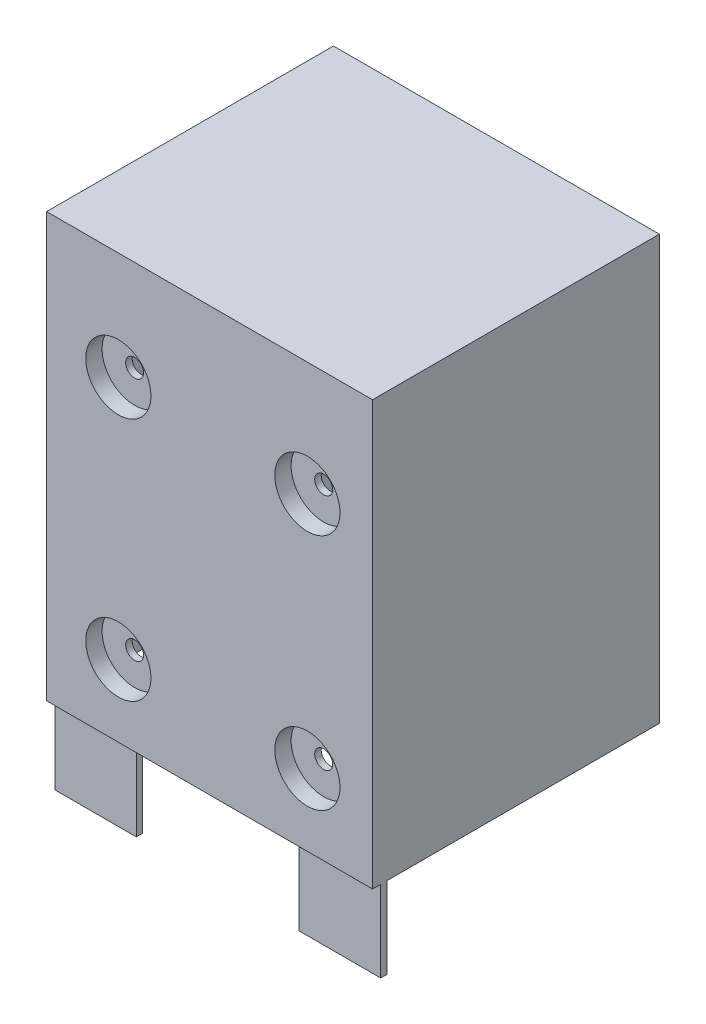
ISO-10303-21;
HEADER;
FILE_DESCRIPTION(('STEP AP214'),'2;1');
FILE_NAME('part.step','',(''),(''),'','','');
FILE_SCHEMA(('AUTOMOTIVE_DESIGN { 1 0 10303 214 1 1 1 1 }'));
ENDSEC;
DATA;
#1=APPLICATION_CONTEXT('core data for automotive mechanical design processes');
#2=APPLICATION_PROTOCOL_DEFINITION('international standard','automotive_design',2000,#1);
#3=PRODUCT_CONTEXT('',#1,'mechanical');
#4=PRODUCT('Part','Part','',(#3));
#5=PRODUCT_RELATED_PRODUCT_CATEGORY('part','',(#4));
#6=PRODUCT_DEFINITION_FORMATION('','',#4);
#7=PRODUCT_DEFINITION_CONTEXT('part definition',#1,'design');
#8=PRODUCT_DEFINITION('design','',#6,#7);
#9=PRODUCT_DEFINITION_SHAPE('','',#8);
#10=(LENGTH_UNIT() NAMED_UNIT(*) SI_UNIT(.MILLI.,.METRE.));
#11=(NAMED_UNIT(*) PLANE_ANGLE_UNIT() SI_UNIT($,.RADIAN.));
#12=(NAMED_UNIT(*) SI_UNIT($,.STERADIAN.) SOLID_ANGLE_UNIT());
#13=UNCERTAINTY_MEASURE_WITH_UNIT(LENGTH_MEASURE(1.E-05),#10,'distance_accuracy_value','');
#14=(GEOMETRIC_REPRESENTATION_CONTEXT(3) GLOBAL_UNCERTAINTY_ASSIGNED_CONTEXT((#13)) GLOBAL_UNIT_ASSIGNED_CONTEXT((#10,
#11,#12)) REPRESENTATION_CONTEXT('',''));
#15=CARTESIAN_POINT('',(0.,0.,0.));
#16=DIRECTION('',(0.,0.,1.));
#17=DIRECTION('',(1.,0.,0.));
#18=AXIS2_PLACEMENT_3D('',#15,#16,#17);
#19=CARTESIAN_POINT('',(0.,0.,0.));
#20=DIRECTION('',(0.,-1.,0.));
#21=DIRECTION('',(0.,0.,-1.));
#22=AXIS2_PLACEMENT_3D('',#19,#20,#21);
#23=PLANE('',#22);
#24=DIRECTION('',(0.,0.,-1.));
#25=VECTOR('',#24,1.);
#26=CARTESIAN_POINT('',(66.,0.,0.));
#27=LINE('',#26,#25);
#28=CARTESIAN_POINT('',(66.,0.,3.));
#29=VERTEX_POINT('',#28);
#30=CARTESIAN_POINT('',(66.,0.,0.0857864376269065));
#31=VERTEX_POINT('',#30);
#32=EDGE_CURVE('E435',#29,#31,#27,.T.);
#33=ORIENTED_EDGE('',*,*,#32,.T.);
#34=CARTESIAN_POINT('',(66.5,0.,1.5));
#35=DIRECTION('',(0.,-1.,0.));
#36=DIRECTION('',(0.,0.,-1.));
#37=AXIS2_PLACEMENT_3D('',#34,#35,#36);
#38=CIRCLE('',#37,1.5);
#39=CARTESIAN_POINT('',(66.5,0.,0.));
#40=VERTEX_POINT('',#39);
#41=EDGE_CURVE('E11',#31,#40,#38,.T.);
#42=ORIENTED_EDGE('',*,*,#41,.T.);
#43=DIRECTION('',(1.,0.,0.));
#44=VECTOR('',#43,1.);
#45=CARTESIAN_POINT('',(0.,0.,0.));
#46=LINE('',#45,#44);
#47=CARTESIAN_POINT('',(100.,0.,0.));
#48=VERTEX_POINT('',#47);
#49=EDGE_CURVE('E655',#40,#48,#46,.T.);
#50=ORIENTED_EDGE('',*,*,#49,.T.);
#51=DIRECTION('',(0.,0.,-1.));
#52=VECTOR('',#51,1.);
#53=CARTESIAN_POINT('',(100.,0.,88.));
#54=LINE('',#53,#52);
#55=CARTESIAN_POINT('',(100.,0.,83.6));
#56=VERTEX_POINT('',#55);
#57=EDGE_CURVE('E679',#56,#48,#54,.T.);
#58=ORIENTED_EDGE('',*,*,#57,.F.);
#59=DIRECTION('',(1.,0.,0.));
#60=VECTOR('',#59,1.);
#61=CARTESIAN_POINT('',(100.,0.,83.6));
#62=LINE('',#61,#60);
#63=CARTESIAN_POINT('',(75.,0.,83.6));
#64=VERTEX_POINT('',#63);
#65=EDGE_CURVE('E764',#64,#56,#62,.T.);
#66=ORIENTED_EDGE('',*,*,#65,.F.);
#67=DIRECTION('',(0.,0.,-1.));
#68=VECTOR('',#67,1.);
#69=CARTESIAN_POINT('',(75.,0.,85.5));
#70=LINE('',#69,#68);
#71=CARTESIAN_POINT('',(75.,0.,85.5));
#72=VERTEX_POINT('',#71);
#73=EDGE_CURVE('E769',#72,#64,#70,.T.);
#74=ORIENTED_EDGE('',*,*,#73,.F.);
#75=DIRECTION('',(-1.,0.,0.));
#76=VECTOR('',#75,1.);
#77=CARTESIAN_POINT('',(100.,0.,85.5));
#78=LINE('',#77,#76);
#79=CARTESIAN_POINT('',(100.,0.,85.5));
#80=VERTEX_POINT('',#79);
#81=EDGE_CURVE('E772',#80,#72,#78,.T.);
#82=ORIENTED_EDGE('',*,*,#81,.F.);
#83=CARTESIAN_POINT('',(100.,0.,88.));
#84=VERTEX_POINT('',#83);
#85=EDGE_CURVE('E675',#84,#80,#54,.T.);
#86=ORIENTED_EDGE('',*,*,#85,.F.);
#87=DIRECTION('',(-1.,0.,0.));
#88=VECTOR('',#87,1.);
#89=CARTESIAN_POINT('',(0.,0.,88.));
#90=LINE('',#89,#88);
#91=CARTESIAN_POINT('',(0.,0.,88.));
#92=VERTEX_POINT('',#91);
#93=EDGE_CURVE('E398',#84,#92,#90,.T.);
#94=ORIENTED_EDGE('',*,*,#93,.T.);
#95=DIRECTION('',(0.,0.,-1.));
#96=VECTOR('',#95,1.);
#97=CARTESIAN_POINT('',(0.,0.,88.));
#98=LINE('',#97,#96);
#99=CARTESIAN_POINT('',(0.,0.,85.5));
#100=VERTEX_POINT('',#99);
#101=EDGE_CURVE('E411',#92,#100,#98,.T.);
#102=ORIENTED_EDGE('',*,*,#101,.T.);
#103=DIRECTION('',(-1.,0.,0.));
#104=VECTOR('',#103,1.);
#105=CARTESIAN_POINT('',(0.,0.,85.5));
#106=LINE('',#105,#104);
#107=CARTESIAN_POINT('',(25.,0.,85.5));
#108=VERTEX_POINT('',#107);
#109=EDGE_CURVE('E701',#108,#100,#106,.T.);
#110=ORIENTED_EDGE('',*,*,#109,.F.);
#111=DIRECTION('',(0.,0.,1.));
#112=VECTOR('',#111,1.);
#113=CARTESIAN_POINT('',(25.,0.,85.5));
#114=LINE('',#113,#112);
#115=CARTESIAN_POINT('',(25.,0.,83.6));
#116=VERTEX_POINT('',#115);
#117=EDGE_CURVE('E715',#116,#108,#114,.T.);
#118=ORIENTED_EDGE('',*,*,#117,.F.);
#119=DIRECTION('',(1.,0.,0.));
#120=VECTOR('',#119,1.);
#121=CARTESIAN_POINT('',(0.,0.,83.6));
#122=LINE('',#121,#120);
#123=CARTESIAN_POINT('',(0.,0.,83.6));
#124=VERTEX_POINT('',#123);
#125=EDGE_CURVE('E739',#124,#116,#122,.T.);
#126=ORIENTED_EDGE('',*,*,#125,.F.);
#127=CARTESIAN_POINT('',(0.,0.,81.));
#128=VERTEX_POINT('',#127);
#129=EDGE_CURVE('E406',#124,#128,#98,.T.);
#130=ORIENTED_EDGE('',*,*,#129,.T.);
#131=DIRECTION('',(1.,0.,0.));
#132=VECTOR('',#131,1.);
#133=CARTESIAN_POINT('',(0.,0.,81.));
#134=LINE('',#133,#132);
#135=CARTESIAN_POINT('',(97.,0.,81.));
#136=VERTEX_POINT('',#135);
#137=EDGE_CURVE('E696',#128,#136,#134,.T.);
#138=ORIENTED_EDGE('',*,*,#137,.T.);
#139=DIRECTION('',(0.,0.,1.));
#140=VECTOR('',#139,1.);
#141=CARTESIAN_POINT('',(97.,0.,3.));
#142=LINE('',#141,#140);
#143=CARTESIAN_POINT('',(97.,0.,3.));
#144=VERTEX_POINT('',#143);
#145=EDGE_CURVE('E613',#144,#136,#142,.T.);
#146=ORIENTED_EDGE('',*,*,#145,.F.);
#147=DIRECTION('',(1.,0.,0.));
#148=VECTOR('',#147,1.);
#149=CARTESIAN_POINT('',(3.,0.,3.));
#150=LINE('',#149,#148);
#151=EDGE_CURVE('E606',#29,#144,#150,.T.);
#152=ORIENTED_EDGE('',*,*,#151,.F.);
#153=EDGE_LOOP('',(#33,#42,#50,#58,#66,#74,#82,#86,#94,#102,#110,#118,#126,#130,#138,#146,#152));
#154=FACE_BOUND('',#153,.T.);
#155=ADVANCED_FACE('F39',(#154),#23,.T.);
#156=CARTESIAN_POINT('',(22.,22.,-0.001000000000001));
#157=DIRECTION('',(0.,0.,1.));
#158=DIRECTION('',(1.,0.,0.));
#159=AXIS2_PLACEMENT_3D('',#156,#157,#158);
#160=CYLINDRICAL_SURFACE('',#159,2.75);
#161=CARTESIAN_POINT('',(22.,22.,81.));
#162=DIRECTION('',(0.,0.,1.));
#163=DIRECTION('',(1.,0.,0.));
#164=AXIS2_PLACEMENT_3D('',#161,#162,#163);
#165=CIRCLE('',#164,2.75);
#166=CARTESIAN_POINT('',(24.75,22.,81.));
#167=VERTEX_POINT('',#166);
#168=EDGE_CURVE('E509',#167,#167,#165,.F.);
#169=ORIENTED_EDGE('',*,*,#168,.T.);
#170=EDGE_LOOP('',(#169));
#171=FACE_BOUND('',#170,.T.);
#172=CARTESIAN_POINT('',(22.,22.,83.));
#173=DIRECTION('',(0.,0.,1.));
#174=DIRECTION('',(1.,0.,0.));
#175=AXIS2_PLACEMENT_3D('',#172,#173,#174);
#176=CIRCLE('',#175,2.75);
#177=CARTESIAN_POINT('',(24.75,22.,83.));
#178=VERTEX_POINT('',#177);
#179=EDGE_CURVE('E493',#178,#178,#176,.F.);
#180=ORIENTED_EDGE('',*,*,#179,.F.);
#181=EDGE_LOOP('',(#180));
#182=FACE_BOUND('',#181,.T.);
#183=ADVANCED_FACE('F331',(#171,#182),#160,.F.);
#184=CARTESIAN_POINT('',(80.,95.,-0.001000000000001));
#185=DIRECTION('',(0.,0.,1.));
#186=DIRECTION('',(1.,0.,0.));
#187=AXIS2_PLACEMENT_3D('',#184,#185,#186);
#188=CYLINDRICAL_SURFACE('',#187,2.75000000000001);
#189=CARTESIAN_POINT('',(80.,95.,81.));
#190=DIRECTION('',(0.,0.,1.));
#191=DIRECTION('',(1.,0.,0.));
#192=AXIS2_PLACEMENT_3D('',#189,#190,#191);
#193=CIRCLE('',#192,2.75000000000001);
#194=CARTESIAN_POINT('',(82.75,95.,81.));
#195=VERTEX_POINT('',#194);
#196=EDGE_CURVE('E497',#195,#195,#193,.F.);
#197=ORIENTED_EDGE('',*,*,#196,.T.);
#198=EDGE_LOOP('',(#197));
#199=FACE_BOUND('',#198,.T.);
#200=CARTESIAN_POINT('',(80.,95.,83.));
#201=DIRECTION('',(0.,0.,1.));
#202=DIRECTION('',(1.,0.,0.));
#203=AXIS2_PLACEMENT_3D('',#200,#201,#202);
#204=CIRCLE('',#203,2.75000000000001);
#205=CARTESIAN_POINT('',(82.75,95.,83.));
#206=VERTEX_POINT('',#205);
#207=EDGE_CURVE('E489',#206,#206,#204,.F.);
#208=ORIENTED_EDGE('',*,*,#207,.F.);
#209=EDGE_LOOP('',(#208));
#210=FACE_BOUND('',#209,.T.);
#211=ADVANCED_FACE('F339',(#199,#210),#188,.F.);
#212=CARTESIAN_POINT('',(22.,97.,-0.001000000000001));
#213=DIRECTION('',(0.,0.,1.));
#214=DIRECTION('',(1.,0.,0.));
#215=AXIS2_PLACEMENT_3D('',#212,#213,#214);
#216=CYLINDRICAL_SURFACE('',#215,2.75);
#217=CARTESIAN_POINT('',(22.,97.,81.));
#218=DIRECTION('',(0.,0.,1.));
#219=DIRECTION('',(1.,0.,0.));
#220=AXIS2_PLACEMENT_3D('',#217,#218,#219);
#221=CIRCLE('',#220,2.75);
#222=CARTESIAN_POINT('',(24.75,97.,81.));
#223=VERTEX_POINT('',#222);
#224=EDGE_CURVE('E501',#223,#223,#221,.F.);
#225=ORIENTED_EDGE('',*,*,#224,.T.);
#226=EDGE_LOOP('',(#225));
#227=FACE_BOUND('',#226,.T.);
#228=CARTESIAN_POINT('',(22.,97.,83.));
#229=DIRECTION('',(0.,0.,1.));
#230=DIRECTION('',(1.,0.,0.));
#231=AXIS2_PLACEMENT_3D('',#228,#229,#230);
#232=CIRCLE('',#231,2.75);
#233=CARTESIAN_POINT('',(24.75,97.,83.));
#234=VERTEX_POINT('',#233);
#235=EDGE_CURVE('E485',#234,#234,#232,.F.);
#236=ORIENTED_EDGE('',*,*,#235,.F.);
#237=EDGE_LOOP('',(#236));
#238=FACE_BOUND('',#237,.T.);
#239=ADVANCED_FACE('F900',(#227,#238),#216,.F.);
#240=CARTESIAN_POINT('',(80.,22.,-0.001000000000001));
#241=DIRECTION('',(0.,0.,1.));
#242=DIRECTION('',(1.,0.,0.));
#243=AXIS2_PLACEMENT_3D('',#240,#241,#242);
#244=CYLINDRICAL_SURFACE('',#243,2.75000000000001);
#245=CARTESIAN_POINT('',(80.,22.,81.));
#246=DIRECTION('',(0.,0.,1.));
#247=DIRECTION('',(1.,0.,0.));
#248=AXIS2_PLACEMENT_3D('',#245,#246,#247);
#249=CIRCLE('',#248,2.75000000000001);
#250=CARTESIAN_POINT('',(82.75,22.,81.));
#251=VERTEX_POINT('',#250);
#252=EDGE_CURVE('E505',#251,#251,#249,.F.);
#253=ORIENTED_EDGE('',*,*,#252,.T.);
#254=EDGE_LOOP('',(#253));
#255=FACE_BOUND('',#254,.T.);
#256=CARTESIAN_POINT('',(80.,22.,83.));
#257=DIRECTION('',(0.,0.,1.));
#258=DIRECTION('',(1.,0.,0.));
#259=AXIS2_PLACEMENT_3D('',#256,#257,#258);
#260=CIRCLE('',#259,2.75000000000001);
#261=CARTESIAN_POINT('',(82.75,22.,83.));
#262=VERTEX_POINT('',#261);
#263=EDGE_CURVE('E481',#262,#262,#260,.F.);
#264=ORIENTED_EDGE('',*,*,#263,.F.);
#265=EDGE_LOOP('',(#264));
#266=FACE_BOUND('',#265,.T.);
#267=ADVANCED_FACE('F903',(#255,#266),#244,.F.);
#268=CARTESIAN_POINT('',(80.,95.,83.));
#269=DIRECTION('',(0.,0.,1.));
#270=DIRECTION('',(1.,0.,0.));
#271=AXIS2_PLACEMENT_3D('',#268,#269,#270);
#272=PLANE('',#271);
#273=CARTESIAN_POINT('',(80.,95.,83.));
#274=DIRECTION('',(0.,0.,1.));
#275=DIRECTION('',(1.,0.,0.));
#276=AXIS2_PLACEMENT_3D('',#273,#274,#275);
#277=CIRCLE('',#276,9.99999999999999);
#278=CARTESIAN_POINT('',(90.,95.,83.));
#279=VERTEX_POINT('',#278);
#280=EDGE_CURVE('E471',#279,#279,#277,.T.);
#281=ORIENTED_EDGE('',*,*,#280,.T.);
#282=EDGE_LOOP('',(#281));
#283=FACE_BOUND('',#282,.T.);
#284=ORIENTED_EDGE('',*,*,#207,.T.);
#285=EDGE_LOOP('',(#284));
#286=FACE_BOUND('',#285,.T.);
#287=ADVANCED_FACE('F907',(#283,#286),#272,.T.);
#288=CARTESIAN_POINT('',(22.,22.,83.));
#289=DIRECTION('',(0.,0.,1.));
#290=DIRECTION('',(1.,0.,0.));
#291=AXIS2_PLACEMENT_3D('',#288,#289,#290);
#292=PLANE('',#291);
#293=CARTESIAN_POINT('',(22.,22.,83.));
#294=DIRECTION('',(0.,0.,1.));
#295=DIRECTION('',(1.,0.,0.));
#296=AXIS2_PLACEMENT_3D('',#293,#294,#295);
#297=CIRCLE('',#296,9.99999999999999);
#298=CARTESIAN_POINT('',(32.,22.,83.));
#299=VERTEX_POINT('',#298);
#300=EDGE_CURVE('E465',#299,#299,#297,.T.);
#301=ORIENTED_EDGE('',*,*,#300,.T.);
#302=EDGE_LOOP('',(#301));
#303=FACE_BOUND('',#302,.T.);
#304=ORIENTED_EDGE('',*,*,#179,.T.);
#305=EDGE_LOOP('',(#304));
#306=FACE_BOUND('',#305,.T.);
#307=ADVANCED_FACE('F922',(#303,#306),#292,.T.);
#308=CARTESIAN_POINT('',(80.,22.,83.));
#309=DIRECTION('',(0.,0.,1.));
#310=DIRECTION('',(1.,0.,0.));
#311=AXIS2_PLACEMENT_3D('',#308,#309,#310);
#312=PLANE('',#311);
#313=CARTESIAN_POINT('',(80.,22.,83.));
#314=DIRECTION('',(0.,0.,1.));
#315=DIRECTION('',(1.,0.,0.));
#316=AXIS2_PLACEMENT_3D('',#313,#314,#315);
#317=CIRCLE('',#316,9.99999999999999);
#318=CARTESIAN_POINT('',(90.,22.,83.));
#319=VERTEX_POINT('',#318);
#320=EDGE_CURVE('E459',#319,#319,#317,.T.);
#321=ORIENTED_EDGE('',*,*,#320,.T.);
#322=EDGE_LOOP('',(#321));
#323=FACE_BOUND('',#322,.T.);
#324=ORIENTED_EDGE('',*,*,#263,.T.);
#325=EDGE_LOOP('',(#324));
#326=FACE_BOUND('',#325,.T.);
#327=ADVANCED_FACE('F344',(#323,#326),#312,.T.);
#328=CARTESIAN_POINT('',(22.,97.,83.));
#329=DIRECTION('',(0.,0.,1.));
#330=DIRECTION('',(1.,0.,0.));
#331=AXIS2_PLACEMENT_3D('',#328,#329,#330);
#332=PLANE('',#331);
#333=CARTESIAN_POINT('',(22.,97.,83.));
#334=DIRECTION('',(0.,0.,1.));
#335=DIRECTION('',(1.,0.,0.));
#336=AXIS2_PLACEMENT_3D('',#333,#334,#335);
#337=CIRCLE('',#336,10.);
#338=CARTESIAN_POINT('',(32.,97.,83.));
#339=VERTEX_POINT('',#338);
#340=EDGE_CURVE('E477',#339,#339,#337,.T.);
#341=ORIENTED_EDGE('',*,*,#340,.T.);
#342=EDGE_LOOP('',(#341));
#343=FACE_BOUND('',#342,.T.);
#344=ORIENTED_EDGE('',*,*,#235,.T.);
#345=EDGE_LOOP('',(#344));
#346=FACE_BOUND('',#345,.T.);
#347=ADVANCED_FACE('F912',(#343,#346),#332,.T.);
#348=CARTESIAN_POINT('',(0.,128.,0.));
#349=DIRECTION('',(0.,1.,0.));
#350=DIRECTION('',(0.,0.,1.));
#351=AXIS2_PLACEMENT_3D('',#348,#349,#350);
#352=PLANE('',#351);
#353=DIRECTION('',(0.,0.,-1.));
#354=VECTOR('',#353,1.);
#355=CARTESIAN_POINT('',(3.,128.,3.));
#356=LINE('',#355,#354);
#357=CARTESIAN_POINT('',(3.,128.,81.));
#358=VERTEX_POINT('',#357);
#359=CARTESIAN_POINT('',(3.,128.,3.));
#360=VERTEX_POINT('',#359);
#361=EDGE_CURVE('E615',#358,#360,#356,.T.);
#362=ORIENTED_EDGE('',*,*,#361,.T.);
#363=DIRECTION('',(1.,0.,0.));
#364=VECTOR('',#363,1.);
#365=CARTESIAN_POINT('',(3.,128.,3.));
#366=LINE('',#365,#364);
#367=CARTESIAN_POINT('',(97.,128.,3.));
#368=VERTEX_POINT('',#367);
#369=EDGE_CURVE('E619',#360,#368,#366,.T.);
#370=ORIENTED_EDGE('',*,*,#369,.T.);
#371=DIRECTION('',(0.,0.,1.));
#372=VECTOR('',#371,1.);
#373=CARTESIAN_POINT('',(97.,128.,3.));
#374=LINE('',#373,#372);
#375=CARTESIAN_POINT('',(97.,128.,81.));
#376=VERTEX_POINT('',#375);
#377=EDGE_CURVE('E623',#368,#376,#374,.T.);
#378=ORIENTED_EDGE('',*,*,#377,.T.);
#379=DIRECTION('',(-1.,0.,0.));
#380=VECTOR('',#379,1.);
#381=CARTESIAN_POINT('',(3.,128.,81.));
#382=LINE('',#381,#380);
#383=EDGE_CURVE('E627',#376,#358,#382,.T.);
#384=ORIENTED_EDGE('',*,*,#383,.T.);
#385=EDGE_LOOP('',(#362,#370,#378,#384));
#386=FACE_BOUND('',#385,.T.);
#387=ADVANCED_FACE('F915',(#386),#352,.F.);
#388=CARTESIAN_POINT('',(97.,128.,3.));
#389=DIRECTION('',(1.,0.,0.));
#390=DIRECTION('',(0.,0.,-1.));
#391=AXIS2_PLACEMENT_3D('',#388,#389,#390);
#392=PLANE('',#391);
#393=DIRECTION('',(0.,-1.,0.));
#394=VECTOR('',#393,1.);
#395=CARTESIAN_POINT('',(97.,128.,3.));
#396=LINE('',#395,#394);
#397=CARTESIAN_POINT('',(97.,2.,3.));
#398=VERTEX_POINT('',#397);
#399=EDGE_CURVE('E639',#368,#398,#396,.T.);
#400=ORIENTED_EDGE('',*,*,#399,.T.);
#401=DIRECTION('',(0.,0.,1.));
#402=VECTOR('',#401,1.);
#403=CARTESIAN_POINT('',(97.,2.,3.));
#404=LINE('',#403,#402);
#405=CARTESIAN_POINT('',(97.,2.,81.));
#406=VERTEX_POINT('',#405);
#407=EDGE_CURVE('E689',#398,#406,#404,.T.);
#408=ORIENTED_EDGE('',*,*,#407,.T.);
#409=DIRECTION('',(0.,-1.,0.));
#410=VECTOR('',#409,1.);
#411=CARTESIAN_POINT('',(97.,128.,81.));
#412=LINE('',#411,#410);
#413=EDGE_CURVE('E646',#376,#406,#412,.T.);
#414=ORIENTED_EDGE('',*,*,#413,.F.);
#415=ORIENTED_EDGE('',*,*,#377,.F.);
#416=EDGE_LOOP('',(#400,#408,#414,#415));
#417=FACE_BOUND('',#416,.T.);
#418=ADVANCED_FACE('F884',(#417),#392,.F.);
#419=CARTESIAN_POINT('',(0.,-100.,81.));
#420=DIRECTION('',(0.,0.,1.));
#421=DIRECTION('',(1.,0.,0.));
#422=AXIS2_PLACEMENT_3D('',#419,#420,#421);
#423=PLANE('',#422);
#424=ORIENTED_EDGE('',*,*,#252,.F.);
#425=EDGE_LOOP('',(#424));
#426=FACE_BOUND('',#425,.T.);
#427=ORIENTED_EDGE('',*,*,#224,.F.);
#428=EDGE_LOOP('',(#427));
#429=FACE_BOUND('',#428,.T.);
#430=ORIENTED_EDGE('',*,*,#196,.F.);
#431=EDGE_LOOP('',(#430));
#432=FACE_BOUND('',#431,.T.);
#433=ORIENTED_EDGE('',*,*,#168,.F.);
#434=EDGE_LOOP('',(#433));
#435=FACE_BOUND('',#434,.T.);
#436=ORIENTED_EDGE('',*,*,#413,.T.);
#437=DIRECTION('',(-1.,0.,0.));
#438=VECTOR('',#437,1.);
#439=CARTESIAN_POINT('',(0.,2.,81.));
#440=LINE('',#439,#438);
#441=CARTESIAN_POINT('',(3.,2.,81.));
#442=VERTEX_POINT('',#441);
#443=EDGE_CURVE('E579',#406,#442,#440,.T.);
#444=ORIENTED_EDGE('',*,*,#443,.T.);
#445=DIRECTION('',(0.,-1.,0.));
#446=VECTOR('',#445,1.);
#447=CARTESIAN_POINT('',(3.,128.,81.));
#448=LINE('',#447,#446);
#449=EDGE_CURVE('E427',#358,#442,#448,.T.);
#450=ORIENTED_EDGE('',*,*,#449,.F.);
#451=ORIENTED_EDGE('',*,*,#383,.F.);
#452=EDGE_LOOP('',(#436,#444,#450,#451));
#453=FACE_BOUND('',#452,.T.);
#454=ADVANCED_FACE('F352',(#426,#429,#432,#435,#453),#423,.F.);
#455=CARTESIAN_POINT('',(3.,128.,3.));
#456=DIRECTION('',(-1.,0.,0.));
#457=DIRECTION('',(0.,0.,1.));
#458=AXIS2_PLACEMENT_3D('',#455,#456,#457);
#459=PLANE('',#458);
#460=ORIENTED_EDGE('',*,*,#449,.T.);
#461=DIRECTION('',(0.,0.,-1.));
#462=VECTOR('',#461,1.);
#463=CARTESIAN_POINT('',(3.,2.,3.));
#464=LINE('',#463,#462);
#465=CARTESIAN_POINT('',(3.,2.,3.));
#466=VERTEX_POINT('',#465);
#467=EDGE_CURVE('E584',#442,#466,#464,.T.);
#468=ORIENTED_EDGE('',*,*,#467,.T.);
#469=DIRECTION('',(0.,-1.,0.));
#470=VECTOR('',#469,1.);
#471=CARTESIAN_POINT('',(3.,128.,3.));
#472=LINE('',#471,#470);
#473=EDGE_CURVE('E631',#360,#466,#472,.T.);
#474=ORIENTED_EDGE('',*,*,#473,.F.);
#475=ORIENTED_EDGE('',*,*,#361,.F.);
#476=EDGE_LOOP('',(#460,#468,#474,#475));
#477=FACE_BOUND('',#476,.T.);
#478=ADVANCED_FACE('F877',(#477),#459,.F.);
#479=CARTESIAN_POINT('',(98.5,0.,0.));
#480=DIRECTION('',(1.,0.,0.));
#481=DIRECTION('',(0.,0.,-1.));
#482=AXIS2_PLACEMENT_3D('',#479,#480,#481);
#483=PLANE('',#482);
#484=DIRECTION('',(0.,-1.,0.));
#485=VECTOR('',#484,1.);
#486=CARTESIAN_POINT('',(98.5,0.999999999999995,1.5));
#487=LINE('',#486,#485);
#488=CARTESIAN_POINT('',(98.5,2.,1.5));
#489=VERTEX_POINT('',#488);
#490=CARTESIAN_POINT('',(98.5,0.999999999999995,1.5));
#491=VERTEX_POINT('',#490);
#492=EDGE_CURVE('E530',#489,#491,#487,.T.);
#493=ORIENTED_EDGE('',*,*,#492,.T.);
#494=DIRECTION('',(0.,0.,1.));
#495=VECTOR('',#494,1.);
#496=CARTESIAN_POINT('',(98.5,0.999999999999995,1.5));
#497=LINE('',#496,#495);
#498=CARTESIAN_POINT('',(98.5,0.999999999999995,82.5));
#499=VERTEX_POINT('',#498);
#500=EDGE_CURVE('E534',#491,#499,#497,.T.);
#501=ORIENTED_EDGE('',*,*,#500,.T.);
#502=DIRECTION('',(0.,1.,0.));
#503=VECTOR('',#502,1.);
#504=CARTESIAN_POINT('',(98.5,0.999999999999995,82.5));
#505=LINE('',#504,#503);
#506=CARTESIAN_POINT('',(98.5,2.,82.5));
#507=VERTEX_POINT('',#506);
#508=EDGE_CURVE('E538',#499,#507,#505,.T.);
#509=ORIENTED_EDGE('',*,*,#508,.T.);
#510=DIRECTION('',(0.,0.,-1.));
#511=VECTOR('',#510,1.);
#512=CARTESIAN_POINT('',(98.5,2.,1.5));
#513=LINE('',#512,#511);
#514=EDGE_CURVE('E542',#507,#489,#513,.T.);
#515=ORIENTED_EDGE('',*,*,#514,.T.);
#516=EDGE_LOOP('',(#493,#501,#509,#515));
#517=FACE_BOUND('',#516,.T.);
#518=ADVANCED_FACE('F889',(#517),#483,.F.);
#519=CARTESIAN_POINT('',(98.5,0.999999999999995,82.5));
#520=DIRECTION('',(0.,0.,1.));
#521=DIRECTION('',(1.,0.,0.));
#522=AXIS2_PLACEMENT_3D('',#519,#520,#521);
#523=PLANE('',#522);
#524=DIRECTION('',(0.,1.,0.));
#525=VECTOR('',#524,1.);
#526=CARTESIAN_POINT('',(0.,0.999999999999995,82.5));
#527=LINE('',#526,#525);
#528=CARTESIAN_POINT('',(0.,0.999999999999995,82.5));
#529=VERTEX_POINT('',#528);
#530=CARTESIAN_POINT('',(0.,2.,82.5));
#531=VERTEX_POINT('',#530);
#532=EDGE_CURVE('E523',#529,#531,#527,.T.);
#533=ORIENTED_EDGE('',*,*,#532,.T.);
#534=DIRECTION('',(-1.,0.,0.));
#535=VECTOR('',#534,1.);
#536=CARTESIAN_POINT('',(98.5,2.,82.5));
#537=LINE('',#536,#535);
#538=EDGE_CURVE('E556',#507,#531,#537,.T.);
#539=ORIENTED_EDGE('',*,*,#538,.F.);
#540=ORIENTED_EDGE('',*,*,#508,.F.);
#541=DIRECTION('',(-1.,0.,0.));
#542=VECTOR('',#541,1.);
#543=CARTESIAN_POINT('',(98.5,0.999999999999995,82.5));
#544=LINE('',#543,#542);
#545=EDGE_CURVE('E553',#499,#529,#544,.T.);
#546=ORIENTED_EDGE('',*,*,#545,.T.);
#547=EDGE_LOOP('',(#533,#539,#540,#546));
#548=FACE_BOUND('',#547,.T.);
#549=ADVANCED_FACE('F362',(#548),#523,.F.);
#550=CARTESIAN_POINT('',(100.,0.,88.));
#551=DIRECTION('',(-1.,0.,0.));
#552=DIRECTION('',(0.,0.,1.));
#553=AXIS2_PLACEMENT_3D('',#550,#551,#552);
#554=PLANE('',#553);
#555=DIRECTION('',(0.,1.,0.));
#556=VECTOR('',#555,1.);
#557=CARTESIAN_POINT('',(100.,0.,88.));
#558=LINE('',#557,#556);
#559=CARTESIAN_POINT('',(100.,130.,88.));
#560=VERTEX_POINT('',#559);
#561=EDGE_CURVE('E400',#84,#560,#558,.T.);
#562=ORIENTED_EDGE('',*,*,#561,.F.);
#563=ORIENTED_EDGE('',*,*,#85,.T.);
#564=DIRECTION('',(0.,1.,0.));
#565=VECTOR('',#564,1.);
#566=CARTESIAN_POINT('',(100.,-24.9,85.5));
#567=LINE('',#566,#565);
#568=CARTESIAN_POINT('',(100.,-24.9,85.5));
#569=VERTEX_POINT('',#568);
#570=EDGE_CURVE('E86',#569,#80,#567,.T.);
#571=ORIENTED_EDGE('',*,*,#570,.F.);
#572=DIRECTION('',(0.,0.,1.));
#573=VECTOR('',#572,1.);
#574=CARTESIAN_POINT('',(100.,-24.9,85.5));
#575=LINE('',#574,#573);
#576=CARTESIAN_POINT('',(100.,-24.9,83.6));
#577=VERTEX_POINT('',#576);
#578=EDGE_CURVE('E768',#577,#569,#575,.T.);
#579=ORIENTED_EDGE('',*,*,#578,.F.);
#580=DIRECTION('',(0.,1.,0.));
#581=VECTOR('',#580,1.);
#582=CARTESIAN_POINT('',(100.,-24.9,83.6));
#583=LINE('',#582,#581);
#584=EDGE_CURVE('E760',#577,#56,#583,.T.);
#585=ORIENTED_EDGE('',*,*,#584,.T.);
#586=ORIENTED_EDGE('',*,*,#57,.T.);
#587=DIRECTION('',(0.,1.,0.));
#588=VECTOR('',#587,1.);
#589=CARTESIAN_POINT('',(100.,0.,0.));
#590=LINE('',#589,#588);
#591=CARTESIAN_POINT('',(100.,130.,0.));
#592=VERTEX_POINT('',#591);
#593=EDGE_CURVE('E661',#48,#592,#590,.T.);
#594=ORIENTED_EDGE('',*,*,#593,.T.);
#595=DIRECTION('',(0.,0.,-1.));
#596=VECTOR('',#595,1.);
#597=CARTESIAN_POINT('',(100.,130.,88.));
#598=LINE('',#597,#596);
#599=EDGE_CURVE('E671',#560,#592,#598,.T.);
#600=ORIENTED_EDGE('',*,*,#599,.F.);
#601=EDGE_LOOP('',(#562,#563,#571,#579,#585,#586,#594,#600));
#602=FACE_BOUND('',#601,.T.);
#603=ADVANCED_FACE('F359',(#602),#554,.F.);
#604=CARTESIAN_POINT('',(0.,130.,88.));
#605=DIRECTION('',(0.,-1.,0.));
#606=DIRECTION('',(0.,0.,-1.));
#607=AXIS2_PLACEMENT_3D('',#604,#605,#606);
#608=PLANE('',#607);
#609=DIRECTION('',(-1.,0.,0.));
#610=VECTOR('',#609,1.);
#611=CARTESIAN_POINT('',(0.,130.,0.));
#612=LINE('',#611,#610);
#613=CARTESIAN_POINT('',(0.,130.,0.));
#614=VERTEX_POINT('',#613);
#615=EDGE_CURVE('E423',#592,#614,#612,.T.);
#616=ORIENTED_EDGE('',*,*,#615,.T.);
#617=DIRECTION('',(0.,0.,-1.));
#618=VECTOR('',#617,1.);
#619=CARTESIAN_POINT('',(0.,130.,88.));
#620=LINE('',#619,#618);
#621=CARTESIAN_POINT('',(0.,130.,88.));
#622=VERTEX_POINT('',#621);
#623=EDGE_CURVE('E667',#622,#614,#620,.T.);
#624=ORIENTED_EDGE('',*,*,#623,.F.);
#625=DIRECTION('',(-1.,0.,0.));
#626=VECTOR('',#625,1.);
#627=CARTESIAN_POINT('',(0.,130.,88.));
#628=LINE('',#627,#626);
#629=EDGE_CURVE('E420',#560,#622,#628,.T.);
#630=ORIENTED_EDGE('',*,*,#629,.F.);
#631=ORIENTED_EDGE('',*,*,#599,.T.);
#632=EDGE_LOOP('',(#616,#624,#630,#631));
#633=FACE_BOUND('',#632,.T.);
#634=ADVANCED_FACE('F361',(#633),#608,.F.);
#635=CARTESIAN_POINT('',(98.5,0.999999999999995,1.5));
#636=DIRECTION('',(0.,0.,-1.));
#637=DIRECTION('',(-1.,0.,0.));
#638=AXIS2_PLACEMENT_3D('',#635,#636,#637);
#639=PLANE('',#638);
#640=DIRECTION('',(-1.,0.,0.));
#641=VECTOR('',#640,1.);
#642=CARTESIAN_POINT('',(98.5,2.,1.5));
#643=LINE('',#642,#641);
#644=CARTESIAN_POINT('',(35.,2.,1.5));
#645=VERTEX_POINT('',#644);
#646=CARTESIAN_POINT('',(0.,2.,1.5));
#647=VERTEX_POINT('',#646);
#648=EDGE_CURVE('E559',#645,#647,#643,.T.);
#649=ORIENTED_EDGE('',*,*,#648,.T.);
#650=DIRECTION('',(0.,-1.,0.));
#651=VECTOR('',#650,1.);
#652=CARTESIAN_POINT('',(0.,0.999999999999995,1.5));
#653=LINE('',#652,#651);
#654=CARTESIAN_POINT('',(0.,0.999999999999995,1.5));
#655=VERTEX_POINT('',#654);
#656=EDGE_CURVE('E513',#647,#655,#653,.T.);
#657=ORIENTED_EDGE('',*,*,#656,.T.);
#658=DIRECTION('',(-1.,0.,0.));
#659=VECTOR('',#658,1.);
#660=CARTESIAN_POINT('',(98.5,0.999999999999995,1.5));
#661=LINE('',#660,#659);
#662=CARTESIAN_POINT('',(35.,0.999999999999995,1.5));
#663=VERTEX_POINT('',#662);
#664=EDGE_CURVE('E546',#663,#655,#661,.T.);
#665=ORIENTED_EDGE('',*,*,#664,.F.);
#666=DIRECTION('',(0.,-1.,0.));
#667=VECTOR('',#666,1.);
#668=CARTESIAN_POINT('',(35.,0.,1.5));
#669=LINE('',#668,#667);
#670=EDGE_CURVE('E591',#645,#663,#669,.T.);
#671=ORIENTED_EDGE('',*,*,#670,.F.);
#672=EDGE_LOOP('',(#649,#657,#665,#671));
#673=FACE_BOUND('',#672,.T.);
#674=ADVANCED_FACE('F831',(#673),#639,.F.);
#675=CARTESIAN_POINT('',(3.,128.,3.));
#676=DIRECTION('',(0.,0.,-1.));
#677=DIRECTION('',(-1.,0.,0.));
#678=AXIS2_PLACEMENT_3D('',#675,#676,#677);
#679=PLANE('',#678);
#680=DIRECTION('',(-1.,0.,0.));
#681=VECTOR('',#680,1.);
#682=CARTESIAN_POINT('',(3.,1.,3.));
#683=LINE('',#682,#681);
#684=CARTESIAN_POINT('',(97.,1.,3.));
#685=VERTEX_POINT('',#684);
#686=CARTESIAN_POINT('',(65.,1.,3.));
#687=VERTEX_POINT('',#686);
#688=EDGE_CURVE('E566',#685,#687,#683,.T.);
#689=ORIENTED_EDGE('',*,*,#688,.T.);
#690=CARTESIAN_POINT('',(66.,1.,3.));
#691=DIRECTION('',(0.,0.,-1.));
#692=DIRECTION('',(-1.,0.,0.));
#693=AXIS2_PLACEMENT_3D('',#690,#691,#692);
#694=CIRCLE('',#693,1.);
#695=EDGE_CURVE('E438',#687,#29,#694,.F.);
#696=ORIENTED_EDGE('',*,*,#695,.T.);
#697=ORIENTED_EDGE('',*,*,#151,.T.);
#698=EDGE_CURVE('E635',#685,#144,#396,.T.);
#699=ORIENTED_EDGE('',*,*,#698,.F.);
#700=EDGE_LOOP('',(#689,#696,#697,#699));
#701=FACE_BOUND('',#700,.T.);
#702=ADVANCED_FACE('F852',(#701),#679,.F.);
#703=CARTESIAN_POINT('',(98.5,0.999999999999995,1.5));
#704=DIRECTION('',(0.,-1.,0.));
#705=DIRECTION('',(0.,0.,-1.));
#706=AXIS2_PLACEMENT_3D('',#703,#704,#705);
#707=PLANE('',#706);
#708=DIRECTION('',(0.,0.,1.));
#709=VECTOR('',#708,1.);
#710=CARTESIAN_POINT('',(0.,0.999999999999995,1.5));
#711=LINE('',#710,#709);
#712=CARTESIAN_POINT('',(0.,0.999999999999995,81.));
#713=VERTEX_POINT('',#712);
#714=EDGE_CURVE('E517',#713,#529,#711,.T.);
#715=ORIENTED_EDGE('',*,*,#714,.T.);
#716=ORIENTED_EDGE('',*,*,#545,.F.);
#717=ORIENTED_EDGE('',*,*,#500,.F.);
#718=CARTESIAN_POINT('',(65.,0.999999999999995,1.5));
#719=VERTEX_POINT('',#718);
#720=EDGE_CURVE('E549',#491,#719,#661,.T.);
#721=ORIENTED_EDGE('',*,*,#720,.T.);
#722=DIRECTION('',(0.,0.,-1.));
#723=VECTOR('',#722,1.);
#724=CARTESIAN_POINT('',(65.,0.999999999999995,30.));
#725=LINE('',#724,#723);
#726=EDGE_CURVE('E569',#687,#719,#725,.T.);
#727=ORIENTED_EDGE('',*,*,#726,.F.);
#728=ORIENTED_EDGE('',*,*,#688,.F.);
#729=DIRECTION('',(0.,0.,-1.));
#730=VECTOR('',#729,1.);
#731=CARTESIAN_POINT('',(97.,1.,3.));
#732=LINE('',#731,#730);
#733=CARTESIAN_POINT('',(97.,1.,81.));
#734=VERTEX_POINT('',#733);
#735=EDGE_CURVE('E685',#734,#685,#732,.T.);
#736=ORIENTED_EDGE('',*,*,#735,.F.);
#737=DIRECTION('',(-1.,0.,0.));
#738=VECTOR('',#737,1.);
#739=CARTESIAN_POINT('',(100.001,1.,81.));
#740=LINE('',#739,#738);
#741=EDGE_CURVE('E598',#734,#713,#740,.T.);
#742=ORIENTED_EDGE('',*,*,#741,.T.);
#743=EDGE_LOOP('',(#715,#716,#717,#721,#727,#728,#736,#742));
#744=FACE_BOUND('',#743,.T.);
#745=ADVANCED_FACE('F350',(#744),#707,.F.);
#746=ORIENTED_EDGE('',*,*,#137,.F.);
#747=DIRECTION('',(0.,1.,0.));
#748=VECTOR('',#747,1.);
#749=CARTESIAN_POINT('',(0.,-100.,81.));
#750=LINE('',#749,#748);
#751=EDGE_CURVE('E424',#128,#713,#750,.T.);
#752=ORIENTED_EDGE('',*,*,#751,.T.);
#753=ORIENTED_EDGE('',*,*,#741,.F.);
#754=EDGE_CURVE('E643',#734,#136,#412,.T.);
#755=ORIENTED_EDGE('',*,*,#754,.T.);
#756=EDGE_LOOP('',(#746,#752,#753,#755));
#757=FACE_BOUND('',#756,.T.);
#758=ADVANCED_FACE('F346',(#757),#423,.F.);
#759=ORIENTED_EDGE('',*,*,#754,.F.);
#760=ORIENTED_EDGE('',*,*,#735,.T.);
#761=ORIENTED_EDGE('',*,*,#698,.T.);
#762=ORIENTED_EDGE('',*,*,#145,.T.);
#763=EDGE_LOOP('',(#759,#760,#761,#762));
#764=FACE_BOUND('',#763,.T.);
#765=ADVANCED_FACE('F349',(#764),#392,.F.);
#766=CARTESIAN_POINT('',(0.,0.,0.));
#767=DIRECTION('',(0.,0.,-1.));
#768=DIRECTION('',(-1.,0.,0.));
#769=AXIS2_PLACEMENT_3D('',#766,#767,#768);
#770=PLANE('',#769);
#771=DIRECTION('',(1.,0.,0.));
#772=VECTOR('',#771,1.);
#773=CARTESIAN_POINT('',(35.,31.5,0.));
#774=LINE('',#773,#772);
#775=CARTESIAN_POINT('',(66.5,31.5,0.));
#776=VERTEX_POINT('',#775);
#777=CARTESIAN_POINT('',(33.5,31.5,0.));
#778=VERTEX_POINT('',#777);
#779=EDGE_CURVE('E266',#776,#778,#774,.F.);
#780=ORIENTED_EDGE('',*,*,#779,.T.);
#781=DIRECTION('',(0.,1.,0.));
#782=VECTOR('',#781,1.);
#783=CARTESIAN_POINT('',(33.5,1.,0.));
#784=LINE('',#783,#782);
#785=CARTESIAN_POINT('',(33.5,0.,0.));
#786=VERTEX_POINT('',#785);
#787=EDGE_CURVE('E270',#778,#786,#784,.F.);
#788=ORIENTED_EDGE('',*,*,#787,.T.);
#789=CARTESIAN_POINT('',(0.,0.,0.));
#790=VERTEX_POINT('',#789);
#791=EDGE_CURVE('E658',#790,#786,#46,.T.);
#792=ORIENTED_EDGE('',*,*,#791,.F.);
#793=DIRECTION('',(0.,-1.,0.));
#794=VECTOR('',#793,1.);
#795=CARTESIAN_POINT('',(0.,0.,0.));
#796=LINE('',#795,#794);
#797=EDGE_CURVE('E428',#614,#790,#796,.T.);
#798=ORIENTED_EDGE('',*,*,#797,.F.);
#799=ORIENTED_EDGE('',*,*,#615,.F.);
#800=ORIENTED_EDGE('',*,*,#593,.F.);
#801=ORIENTED_EDGE('',*,*,#49,.F.);
#802=DIRECTION('',(0.,-1.,0.));
#803=VECTOR('',#802,1.);
#804=CARTESIAN_POINT('',(66.5,30.,0.));
#805=LINE('',#804,#803);
#806=EDGE_CURVE('E274',#40,#776,#805,.F.);
#807=ORIENTED_EDGE('',*,*,#806,.T.);
#808=EDGE_LOOP('',(#780,#788,#792,#798,#799,#800,#801,#807));
#809=FACE_BOUND('',#808,.T.);
#810=ADVANCED_FACE('F267',(#809),#770,.T.);
#811=DIRECTION('',(1.,0.,0.));
#812=VECTOR('',#811,1.);
#813=CARTESIAN_POINT('',(3.,2.,3.));
#814=LINE('',#813,#812);
#815=CARTESIAN_POINT('',(33.5,2.,3.));
#816=VERTEX_POINT('',#815);
#817=EDGE_CURVE('E581',#466,#816,#814,.T.);
#818=ORIENTED_EDGE('',*,*,#817,.T.);
#819=DIRECTION('',(0.,-1.,0.));
#820=VECTOR('',#819,1.);
#821=CARTESIAN_POINT('',(33.5,128.,3.));
#822=LINE('',#821,#820);
#823=CARTESIAN_POINT('',(33.5,31.5,3.));
#824=VERTEX_POINT('',#823);
#825=EDGE_CURVE('E453',#816,#824,#822,.F.);
#826=ORIENTED_EDGE('',*,*,#825,.T.);
#827=DIRECTION('',(-1.,0.,0.));
#828=VECTOR('',#827,1.);
#829=CARTESIAN_POINT('',(3.,31.5,3.));
#830=LINE('',#829,#828);
#831=CARTESIAN_POINT('',(66.5,31.5,3.));
#832=VERTEX_POINT('',#831);
#833=EDGE_CURVE('E450',#824,#832,#830,.F.);
#834=ORIENTED_EDGE('',*,*,#833,.T.);
#835=DIRECTION('',(0.,1.,0.));
#836=VECTOR('',#835,1.);
#837=CARTESIAN_POINT('',(66.5,128.,3.));
#838=LINE('',#837,#836);
#839=CARTESIAN_POINT('',(66.5,2.,3.));
#840=VERTEX_POINT('',#839);
#841=EDGE_CURVE('E447',#832,#840,#838,.F.);
#842=ORIENTED_EDGE('',*,*,#841,.T.);
#843=EDGE_CURVE('E576',#840,#398,#814,.T.);
#844=ORIENTED_EDGE('',*,*,#843,.T.);
#845=ORIENTED_EDGE('',*,*,#399,.F.);
#846=ORIENTED_EDGE('',*,*,#369,.F.);
#847=ORIENTED_EDGE('',*,*,#473,.T.);
#848=EDGE_LOOP('',(#818,#826,#834,#842,#844,#845,#846,#847));
#849=FACE_BOUND('',#848,.T.);
#850=ADVANCED_FACE('F873',(#849),#679,.F.);
#851=CARTESIAN_POINT('',(98.5,2.,1.5));
#852=DIRECTION('',(0.,1.,0.));
#853=DIRECTION('',(0.,0.,1.));
#854=AXIS2_PLACEMENT_3D('',#851,#852,#853);
#855=PLANE('',#854);
#856=ORIENTED_EDGE('',*,*,#648,.F.);
#857=CARTESIAN_POINT('',(33.5,2.,1.5));
#858=DIRECTION('',(0.,1.,0.));
#859=DIRECTION('',(0.,0.,1.));
#860=AXIS2_PLACEMENT_3D('',#857,#858,#859);
#861=CIRCLE('',#860,1.5);
#862=EDGE_CURVE('E444',#645,#816,#861,.F.);
#863=ORIENTED_EDGE('',*,*,#862,.T.);
#864=ORIENTED_EDGE('',*,*,#817,.F.);
#865=ORIENTED_EDGE('',*,*,#467,.F.);
#866=ORIENTED_EDGE('',*,*,#443,.F.);
#867=ORIENTED_EDGE('',*,*,#407,.F.);
#868=ORIENTED_EDGE('',*,*,#843,.F.);
#869=CARTESIAN_POINT('',(66.5,2.,1.5));
#870=DIRECTION('',(0.,1.,0.));
#871=DIRECTION('',(0.,0.,1.));
#872=AXIS2_PLACEMENT_3D('',#869,#870,#871);
#873=CIRCLE('',#872,1.5);
#874=CARTESIAN_POINT('',(65.,2.,1.5));
#875=VERTEX_POINT('',#874);
#876=EDGE_CURVE('E441',#840,#875,#873,.F.);
#877=ORIENTED_EDGE('',*,*,#876,.T.);
#878=EDGE_CURVE('E562',#489,#875,#643,.T.);
#879=ORIENTED_EDGE('',*,*,#878,.F.);
#880=ORIENTED_EDGE('',*,*,#514,.F.);
#881=ORIENTED_EDGE('',*,*,#538,.T.);
#882=DIRECTION('',(0.,0.,-1.));
#883=VECTOR('',#882,1.);
#884=CARTESIAN_POINT('',(0.,2.,1.5));
#885=LINE('',#884,#883);
#886=EDGE_CURVE('E526',#531,#647,#885,.T.);
#887=ORIENTED_EDGE('',*,*,#886,.T.);
#888=EDGE_LOOP('',(#856,#863,#864,#865,#866,#867,#868,#877,#879,#880,#881,#887));
#889=FACE_BOUND('',#888,.T.);
#890=ADVANCED_FACE('F833',(#889),#855,.F.);
#891=ORIENTED_EDGE('',*,*,#720,.F.);
#892=ORIENTED_EDGE('',*,*,#492,.F.);
#893=ORIENTED_EDGE('',*,*,#878,.T.);
#894=DIRECTION('',(0.,1.,0.));
#895=VECTOR('',#894,1.);
#896=CARTESIAN_POINT('',(65.,0.,1.5));
#897=LINE('',#896,#895);
#898=EDGE_CURVE('E693',#719,#875,#897,.T.);
#899=ORIENTED_EDGE('',*,*,#898,.F.);
#900=EDGE_LOOP('',(#891,#892,#893,#899));
#901=FACE_BOUND('',#900,.T.);
#902=ADVANCED_FACE('F357',(#901),#639,.F.);
#903=CARTESIAN_POINT('',(0.,0.,88.));
#904=DIRECTION('',(1.,0.,0.));
#905=DIRECTION('',(0.,0.,-1.));
#906=AXIS2_PLACEMENT_3D('',#903,#904,#905);
#907=PLANE('',#906);
#908=ORIENTED_EDGE('',*,*,#101,.F.);
#909=DIRECTION('',(0.,-1.,0.));
#910=VECTOR('',#909,1.);
#911=CARTESIAN_POINT('',(0.,0.,88.));
#912=LINE('',#911,#910);
#913=EDGE_CURVE('E403',#622,#92,#912,.T.);
#914=ORIENTED_EDGE('',*,*,#913,.F.);
#915=ORIENTED_EDGE('',*,*,#623,.T.);
#916=ORIENTED_EDGE('',*,*,#797,.T.);
#917=DIRECTION('',(0.,0.,-1.));
#918=VECTOR('',#917,1.);
#919=CARTESIAN_POINT('',(0.,0.,88.));
#920=LINE('',#919,#918);
#921=CARTESIAN_POINT('',(0.,0.,3.));
#922=VERTEX_POINT('',#921);
#923=EDGE_CURVE('E683',#922,#790,#920,.T.);
#924=ORIENTED_EDGE('',*,*,#923,.F.);
#925=DIRECTION('',(0.,-1.,0.));
#926=VECTOR('',#925,1.);
#927=CARTESIAN_POINT('',(0.,0.,3.));
#928=LINE('',#927,#926);
#929=CARTESIAN_POINT('',(0.,0.999999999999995,3.));
#930=VERTEX_POINT('',#929);
#931=EDGE_CURVE('E594',#930,#922,#928,.T.);
#932=ORIENTED_EDGE('',*,*,#931,.F.);
#933=EDGE_CURVE('E520',#655,#930,#711,.T.);
#934=ORIENTED_EDGE('',*,*,#933,.F.);
#935=ORIENTED_EDGE('',*,*,#656,.F.);
#936=ORIENTED_EDGE('',*,*,#886,.F.);
#937=ORIENTED_EDGE('',*,*,#532,.F.);
#938=ORIENTED_EDGE('',*,*,#714,.F.);
#939=ORIENTED_EDGE('',*,*,#751,.F.);
#940=ORIENTED_EDGE('',*,*,#129,.F.);
#941=DIRECTION('',(0.,1.,0.));
#942=VECTOR('',#941,1.);
#943=CARTESIAN_POINT('',(0.,-24.9,83.6));
#944=LINE('',#943,#942);
#945=CARTESIAN_POINT('',(0.,-24.9,83.6));
#946=VERTEX_POINT('',#945);
#947=EDGE_CURVE('E407',#946,#124,#944,.T.);
#948=ORIENTED_EDGE('',*,*,#947,.F.);
#949=DIRECTION('',(0.,0.,-1.));
#950=VECTOR('',#949,1.);
#951=CARTESIAN_POINT('',(0.,-24.9,85.5));
#952=LINE('',#951,#950);
#953=CARTESIAN_POINT('',(0.,-24.9,85.5));
#954=VERTEX_POINT('',#953);
#955=EDGE_CURVE('E714',#954,#946,#952,.T.);
#956=ORIENTED_EDGE('',*,*,#955,.F.);
#957=DIRECTION('',(0.,1.,0.));
#958=VECTOR('',#957,1.);
#959=CARTESIAN_POINT('',(0.,-24.9,85.5));
#960=LINE('',#959,#958);
#961=EDGE_CURVE('E709',#954,#100,#960,.T.);
#962=ORIENTED_EDGE('',*,*,#961,.T.);
#963=EDGE_LOOP('',(#908,#914,#915,#916,#924,#932,#934,#935,#936,#937,#938,#939,#940,#948,#956,#962));
#964=FACE_BOUND('',#963,.T.);
#965=ADVANCED_FACE('F353',(#964),#907,.F.);
#966=ORIENTED_EDGE('',*,*,#664,.T.);
#967=ORIENTED_EDGE('',*,*,#933,.T.);
#968=DIRECTION('',(-1.,0.,0.));
#969=VECTOR('',#968,1.);
#970=CARTESIAN_POINT('',(100.001,0.99999999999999,3.));
#971=LINE('',#970,#969);
#972=CARTESIAN_POINT('',(35.,1.,3.));
#973=VERTEX_POINT('',#972);
#974=EDGE_CURVE('E602',#973,#930,#971,.T.);
#975=ORIENTED_EDGE('',*,*,#974,.F.);
#976=DIRECTION('',(0.,0.,1.));
#977=VECTOR('',#976,1.);
#978=CARTESIAN_POINT('',(35.,0.999999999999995,30.));
#979=LINE('',#978,#977);
#980=EDGE_CURVE('E572',#663,#973,#979,.T.);
#981=ORIENTED_EDGE('',*,*,#980,.F.);
#982=EDGE_LOOP('',(#966,#967,#975,#981));
#983=FACE_BOUND('',#982,.T.);
#984=ADVANCED_FACE('F356',(#983),#707,.F.);
#985=CARTESIAN_POINT('',(34.,0.,3.));
#986=VERTEX_POINT('',#985);
#987=EDGE_CURVE('E609',#922,#986,#150,.T.);
#988=ORIENTED_EDGE('',*,*,#987,.T.);
#989=CARTESIAN_POINT('',(34.,1.,3.));
#990=DIRECTION('',(0.,0.,-1.));
#991=DIRECTION('',(-1.,0.,0.));
#992=AXIS2_PLACEMENT_3D('',#989,#990,#991);
#993=CIRCLE('',#992,1.);
#994=EDGE_CURVE('E432',#986,#973,#993,.F.);
#995=ORIENTED_EDGE('',*,*,#994,.T.);
#996=ORIENTED_EDGE('',*,*,#974,.T.);
#997=ORIENTED_EDGE('',*,*,#931,.T.);
#998=EDGE_LOOP('',(#988,#995,#996,#997));
#999=FACE_BOUND('',#998,.T.);
#1000=ADVANCED_FACE('F820',(#999),#679,.F.);
#1001=CARTESIAN_POINT('',(80.,95.,83.));
#1002=DIRECTION('',(0.,0.,1.));
#1003=DIRECTION('',(1.,0.,0.));
#1004=AXIS2_PLACEMENT_3D('',#1001,#1002,#1003);
#1005=CYLINDRICAL_SURFACE('',#1004,9.99999999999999);
#1006=ORIENTED_EDGE('',*,*,#280,.F.);
#1007=EDGE_LOOP('',(#1006));
#1008=FACE_BOUND('',#1007,.T.);
#1009=CARTESIAN_POINT('',(80.,95.,88.));
#1010=DIRECTION('',(0.,0.,1.));
#1011=DIRECTION('',(1.,0.,0.));
#1012=AXIS2_PLACEMENT_3D('',#1009,#1010,#1011);
#1013=CIRCLE('',#1012,9.99999999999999);
#1014=CARTESIAN_POINT('',(90.,95.,88.));
#1015=VERTEX_POINT('',#1014);
#1016=EDGE_CURVE('E395',#1015,#1015,#1013,.T.);
#1017=ORIENTED_EDGE('',*,*,#1016,.T.);
#1018=EDGE_LOOP('',(#1017));
#1019=FACE_BOUND('',#1018,.T.);
#1020=ADVANCED_FACE('F920',(#1008,#1019),#1005,.F.);
#1021=CARTESIAN_POINT('',(22.,22.,83.));
#1022=DIRECTION('',(0.,0.,1.));
#1023=DIRECTION('',(1.,0.,0.));
#1024=AXIS2_PLACEMENT_3D('',#1021,#1022,#1023);
#1025=CYLINDRICAL_SURFACE('',#1024,9.99999999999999);
#1026=ORIENTED_EDGE('',*,*,#300,.F.);
#1027=EDGE_LOOP('',(#1026));
#1028=FACE_BOUND('',#1027,.T.);
#1029=CARTESIAN_POINT('',(22.,22.,88.));
#1030=DIRECTION('',(0.,0.,1.));
#1031=DIRECTION('',(1.,0.,0.));
#1032=AXIS2_PLACEMENT_3D('',#1029,#1030,#1031);
#1033=CIRCLE('',#1032,9.99999999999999);
#1034=CARTESIAN_POINT('',(32.,22.,88.));
#1035=VERTEX_POINT('',#1034);
#1036=EDGE_CURVE('E391',#1035,#1035,#1033,.T.);
#1037=ORIENTED_EDGE('',*,*,#1036,.T.);
#1038=EDGE_LOOP('',(#1037));
#1039=FACE_BOUND('',#1038,.T.);
#1040=ADVANCED_FACE('F917',(#1028,#1039),#1025,.F.);
#1041=CARTESIAN_POINT('',(80.,22.,83.));
#1042=DIRECTION('',(0.,0.,1.));
#1043=DIRECTION('',(1.,0.,0.));
#1044=AXIS2_PLACEMENT_3D('',#1041,#1042,#1043);
#1045=CYLINDRICAL_SURFACE('',#1044,9.99999999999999);
#1046=ORIENTED_EDGE('',*,*,#320,.F.);
#1047=EDGE_LOOP('',(#1046));
#1048=FACE_BOUND('',#1047,.T.);
#1049=CARTESIAN_POINT('',(80.,22.,88.));
#1050=DIRECTION('',(0.,0.,1.));
#1051=DIRECTION('',(1.,0.,0.));
#1052=AXIS2_PLACEMENT_3D('',#1049,#1050,#1051);
#1053=CIRCLE('',#1052,9.99999999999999);
#1054=CARTESIAN_POINT('',(90.,22.,88.));
#1055=VERTEX_POINT('',#1054);
#1056=EDGE_CURVE('E387',#1055,#1055,#1053,.T.);
#1057=ORIENTED_EDGE('',*,*,#1056,.T.);
#1058=EDGE_LOOP('',(#1057));
#1059=FACE_BOUND('',#1058,.T.);
#1060=ADVANCED_FACE('F377',(#1048,#1059),#1045,.F.);
#1061=CARTESIAN_POINT('',(22.,97.,83.));
#1062=DIRECTION('',(0.,0.,1.));
#1063=DIRECTION('',(1.,0.,0.));
#1064=AXIS2_PLACEMENT_3D('',#1061,#1062,#1063);
#1065=CYLINDRICAL_SURFACE('',#1064,10.);
#1066=ORIENTED_EDGE('',*,*,#340,.F.);
#1067=EDGE_LOOP('',(#1066));
#1068=FACE_BOUND('',#1067,.T.);
#1069=CARTESIAN_POINT('',(22.,97.,88.));
#1070=DIRECTION('',(0.,0.,1.));
#1071=DIRECTION('',(1.,0.,0.));
#1072=AXIS2_PLACEMENT_3D('',#1069,#1070,#1071);
#1073=CIRCLE('',#1072,10.);
#1074=CARTESIAN_POINT('',(32.,97.,88.));
#1075=VERTEX_POINT('',#1074);
#1076=EDGE_CURVE('E383',#1075,#1075,#1073,.T.);
#1077=ORIENTED_EDGE('',*,*,#1076,.T.);
#1078=EDGE_LOOP('',(#1077));
#1079=FACE_BOUND('',#1078,.T.);
#1080=ADVANCED_FACE('F367',(#1068,#1079),#1065,.F.);
#1081=CARTESIAN_POINT('',(0.,0.,88.));
#1082=DIRECTION('',(0.,0.,-1.));
#1083=DIRECTION('',(-1.,0.,0.));
#1084=AXIS2_PLACEMENT_3D('',#1081,#1082,#1083);
#1085=PLANE('',#1084);
#1086=ORIENTED_EDGE('',*,*,#1076,.F.);
#1087=EDGE_LOOP('',(#1086));
#1088=FACE_BOUND('',#1087,.T.);
#1089=ORIENTED_EDGE('',*,*,#1056,.F.);
#1090=EDGE_LOOP('',(#1089));
#1091=FACE_BOUND('',#1090,.T.);
#1092=ORIENTED_EDGE('',*,*,#1036,.F.);
#1093=EDGE_LOOP('',(#1092));
#1094=FACE_BOUND('',#1093,.T.);
#1095=ORIENTED_EDGE('',*,*,#1016,.F.);
#1096=EDGE_LOOP('',(#1095));
#1097=FACE_BOUND('',#1096,.T.);
#1098=ORIENTED_EDGE('',*,*,#93,.F.);
#1099=ORIENTED_EDGE('',*,*,#561,.T.);
#1100=ORIENTED_EDGE('',*,*,#629,.T.);
#1101=ORIENTED_EDGE('',*,*,#913,.T.);
#1102=EDGE_LOOP('',(#1098,#1099,#1100,#1101));
#1103=FACE_BOUND('',#1102,.T.);
#1104=ADVANCED_FACE('F364',(#1088,#1091,#1094,#1097,#1103),#1085,.F.);
#1105=CARTESIAN_POINT('',(0.,0.,88.));
#1106=DIRECTION('',(0.,1.,0.));
#1107=DIRECTION('',(0.,0.,1.));
#1108=AXIS2_PLACEMENT_3D('',#1105,#1106,#1107);
#1109=PLANE('',#1108);
#1110=ORIENTED_EDGE('',*,*,#791,.T.);
#1111=CARTESIAN_POINT('',(33.5,0.,1.5));
#1112=DIRECTION('',(0.,1.,0.));
#1113=DIRECTION('',(0.,0.,1.));
#1114=AXIS2_PLACEMENT_3D('',#1111,#1112,#1113);
#1115=CIRCLE('',#1114,1.5);
#1116=CARTESIAN_POINT('',(34.,0.,0.0857864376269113));
#1117=VERTEX_POINT('',#1116);
#1118=EDGE_CURVE('E288',#786,#1117,#1115,.F.);
#1119=ORIENTED_EDGE('',*,*,#1118,.T.);
#1120=DIRECTION('',(0.,0.,-1.));
#1121=VECTOR('',#1120,1.);
#1122=CARTESIAN_POINT('',(34.,0.,88.));
#1123=LINE('',#1122,#1121);
#1124=EDGE_CURVE('E429',#1117,#986,#1123,.F.);
#1125=ORIENTED_EDGE('',*,*,#1124,.T.);
#1126=ORIENTED_EDGE('',*,*,#987,.F.);
#1127=ORIENTED_EDGE('',*,*,#923,.T.);
#1128=EDGE_LOOP('',(#1110,#1119,#1125,#1126,#1127));
#1129=FACE_BOUND('',#1128,.T.);
#1130=ADVANCED_FACE('F366',(#1129),#1109,.F.);
#1131=CARTESIAN_POINT('',(0.,-24.9,83.6));
#1132=DIRECTION('',(0.,0.,1.));
#1133=DIRECTION('',(1.,0.,0.));
#1134=AXIS2_PLACEMENT_3D('',#1131,#1132,#1133);
#1135=PLANE('',#1134);
#1136=ORIENTED_EDGE('',*,*,#125,.T.);
#1137=DIRECTION('',(0.,1.,0.));
#1138=VECTOR('',#1137,1.);
#1139=CARTESIAN_POINT('',(25.,-24.9,83.6));
#1140=LINE('',#1139,#1138);
#1141=CARTESIAN_POINT('',(25.,-24.9,83.6));
#1142=VERTEX_POINT('',#1141);
#1143=EDGE_CURVE('E414',#1142,#116,#1140,.T.);
#1144=ORIENTED_EDGE('',*,*,#1143,.F.);
#1145=DIRECTION('',(1.,0.,0.));
#1146=VECTOR('',#1145,1.);
#1147=CARTESIAN_POINT('',(0.,-24.9,83.6));
#1148=LINE('',#1147,#1146);
#1149=EDGE_CURVE('E737',#946,#1142,#1148,.T.);
#1150=ORIENTED_EDGE('',*,*,#1149,.F.);
#1151=ORIENTED_EDGE('',*,*,#947,.T.);
#1152=EDGE_LOOP('',(#1136,#1144,#1150,#1151));
#1153=FACE_BOUND('',#1152,.T.);
#1154=ADVANCED_FACE('F374',(#1153),#1135,.F.);
#1155=CARTESIAN_POINT('',(25.,-24.9,85.5));
#1156=DIRECTION('',(-1.,0.,0.));
#1157=DIRECTION('',(0.,0.,1.));
#1158=AXIS2_PLACEMENT_3D('',#1155,#1156,#1157);
#1159=PLANE('',#1158);
#1160=ORIENTED_EDGE('',*,*,#117,.T.);
#1161=DIRECTION('',(0.,1.,0.));
#1162=VECTOR('',#1161,1.);
#1163=CARTESIAN_POINT('',(25.,-24.9,85.5));
#1164=LINE('',#1163,#1162);
#1165=CARTESIAN_POINT('',(25.,-24.9,85.5));
#1166=VERTEX_POINT('',#1165);
#1167=EDGE_CURVE('E712',#1166,#108,#1164,.T.);
#1168=ORIENTED_EDGE('',*,*,#1167,.F.);
#1169=DIRECTION('',(0.,0.,1.));
#1170=VECTOR('',#1169,1.);
#1171=CARTESIAN_POINT('',(25.,-24.9,85.5));
#1172=LINE('',#1171,#1170);
#1173=EDGE_CURVE('E725',#1142,#1166,#1172,.T.);
#1174=ORIENTED_EDGE('',*,*,#1173,.F.);
#1175=ORIENTED_EDGE('',*,*,#1143,.T.);
#1176=EDGE_LOOP('',(#1160,#1168,#1174,#1175));
#1177=FACE_BOUND('',#1176,.T.);
#1178=ADVANCED_FACE('F734',(#1177),#1159,.F.);
#1179=CARTESIAN_POINT('',(0.,-24.9,85.5));
#1180=DIRECTION('',(0.,0.,-1.));
#1181=DIRECTION('',(-1.,0.,0.));
#1182=AXIS2_PLACEMENT_3D('',#1179,#1180,#1181);
#1183=PLANE('',#1182);
#1184=ORIENTED_EDGE('',*,*,#109,.T.);
#1185=ORIENTED_EDGE('',*,*,#961,.F.);
#1186=DIRECTION('',(-1.,0.,0.));
#1187=VECTOR('',#1186,1.);
#1188=CARTESIAN_POINT('',(0.,-24.9,85.5));
#1189=LINE('',#1188,#1187);
#1190=EDGE_CURVE('E720',#1166,#954,#1189,.T.);
#1191=ORIENTED_EDGE('',*,*,#1190,.F.);
#1192=ORIENTED_EDGE('',*,*,#1167,.T.);
#1193=EDGE_LOOP('',(#1184,#1185,#1191,#1192));
#1194=FACE_BOUND('',#1193,.T.);
#1195=ADVANCED_FACE('F707',(#1194),#1183,.F.);
#1196=CARTESIAN_POINT('',(0.,-24.9,0.));
#1197=DIRECTION('',(0.,-1.,0.));
#1198=DIRECTION('',(0.,0.,-1.));
#1199=AXIS2_PLACEMENT_3D('',#1196,#1197,#1198);
#1200=PLANE('',#1199);
#1201=ORIENTED_EDGE('',*,*,#955,.T.);
#1202=ORIENTED_EDGE('',*,*,#1149,.T.);
#1203=ORIENTED_EDGE('',*,*,#1173,.T.);
#1204=ORIENTED_EDGE('',*,*,#1190,.T.);
#1205=EDGE_LOOP('',(#1201,#1202,#1203,#1204));
#1206=FACE_BOUND('',#1205,.T.);
#1207=ADVANCED_FACE('F1082',(#1206),#1200,.T.);
#1208=CARTESIAN_POINT('',(100.,-24.9,85.5));
#1209=DIRECTION('',(0.,0.,-1.));
#1210=DIRECTION('',(-1.,0.,0.));
#1211=AXIS2_PLACEMENT_3D('',#1208,#1209,#1210);
#1212=PLANE('',#1211);
#1213=ORIENTED_EDGE('',*,*,#81,.T.);
#1214=DIRECTION('',(0.,1.,0.));
#1215=VECTOR('',#1214,1.);
#1216=CARTESIAN_POINT('',(75.,-24.9,85.5));
#1217=LINE('',#1216,#1215);
#1218=CARTESIAN_POINT('',(75.,-24.9,85.5));
#1219=VERTEX_POINT('',#1218);
#1220=EDGE_CURVE('E744',#1219,#72,#1217,.T.);
#1221=ORIENTED_EDGE('',*,*,#1220,.F.);
#1222=DIRECTION('',(-1.,0.,0.));
#1223=VECTOR('',#1222,1.);
#1224=CARTESIAN_POINT('',(100.,-24.9,85.5));
#1225=LINE('',#1224,#1223);
#1226=EDGE_CURVE('E782',#569,#1219,#1225,.T.);
#1227=ORIENTED_EDGE('',*,*,#1226,.F.);
#1228=ORIENTED_EDGE('',*,*,#570,.T.);
#1229=EDGE_LOOP('',(#1213,#1221,#1227,#1228));
#1230=FACE_BOUND('',#1229,.T.);
#1231=ADVANCED_FACE('F798',(#1230),#1212,.F.);
#1232=CARTESIAN_POINT('',(75.,-24.9,85.5));
#1233=DIRECTION('',(1.,0.,0.));
#1234=DIRECTION('',(0.,0.,-1.));
#1235=AXIS2_PLACEMENT_3D('',#1232,#1233,#1234);
#1236=PLANE('',#1235);
#1237=ORIENTED_EDGE('',*,*,#73,.T.);
#1238=DIRECTION('',(0.,1.,0.));
#1239=VECTOR('',#1238,1.);
#1240=CARTESIAN_POINT('',(75.,-24.9,83.6));
#1241=LINE('',#1240,#1239);
#1242=CARTESIAN_POINT('',(75.,-24.9,83.6));
#1243=VERTEX_POINT('',#1242);
#1244=EDGE_CURVE('E756',#1243,#64,#1241,.T.);
#1245=ORIENTED_EDGE('',*,*,#1244,.F.);
#1246=DIRECTION('',(0.,0.,-1.));
#1247=VECTOR('',#1246,1.);
#1248=CARTESIAN_POINT('',(75.,-24.9,85.5));
#1249=LINE('',#1248,#1247);
#1250=EDGE_CURVE('E778',#1219,#1243,#1249,.T.);
#1251=ORIENTED_EDGE('',*,*,#1250,.F.);
#1252=ORIENTED_EDGE('',*,*,#1220,.T.);
#1253=EDGE_LOOP('',(#1237,#1245,#1251,#1252));
#1254=FACE_BOUND('',#1253,.T.);
#1255=ADVANCED_FACE('F801',(#1254),#1236,.F.);
#1256=CARTESIAN_POINT('',(100.,-24.9,83.6));
#1257=DIRECTION('',(0.,0.,1.));
#1258=DIRECTION('',(1.,0.,0.));
#1259=AXIS2_PLACEMENT_3D('',#1256,#1257,#1258);
#1260=PLANE('',#1259);
#1261=ORIENTED_EDGE('',*,*,#65,.T.);
#1262=ORIENTED_EDGE('',*,*,#584,.F.);
#1263=DIRECTION('',(1.,0.,0.));
#1264=VECTOR('',#1263,1.);
#1265=CARTESIAN_POINT('',(100.,-24.9,83.6));
#1266=LINE('',#1265,#1264);
#1267=EDGE_CURVE('E763',#1243,#577,#1266,.T.);
#1268=ORIENTED_EDGE('',*,*,#1267,.F.);
#1269=ORIENTED_EDGE('',*,*,#1244,.T.);
#1270=EDGE_LOOP('',(#1261,#1262,#1268,#1269));
#1271=FACE_BOUND('',#1270,.T.);
#1272=ADVANCED_FACE('F806',(#1271),#1260,.F.);
#1273=CARTESIAN_POINT('',(0.,-24.9,0.));
#1274=DIRECTION('',(0.,1.,0.));
#1275=DIRECTION('',(0.,0.,1.));
#1276=AXIS2_PLACEMENT_3D('',#1273,#1274,#1275);
#1277=PLANE('',#1276);
#1278=ORIENTED_EDGE('',*,*,#578,.T.);
#1279=ORIENTED_EDGE('',*,*,#1226,.T.);
#1280=ORIENTED_EDGE('',*,*,#1250,.T.);
#1281=ORIENTED_EDGE('',*,*,#1267,.T.);
#1282=EDGE_LOOP('',(#1278,#1279,#1280,#1281));
#1283=FACE_BOUND('',#1282,.T.);
#1284=ADVANCED_FACE('F790',(#1283),#1277,.F.);
#1285=CARTESIAN_POINT('',(34.,1.,30.));
#1286=DIRECTION('',(0.,0.,-1.));
#1287=DIRECTION('',(-1.,0.,0.));
#1288=AXIS2_PLACEMENT_3D('',#1285,#1286,#1287);
#1289=CYLINDRICAL_SURFACE('',#1288,1.);
#1290=ORIENTED_EDGE('',*,*,#1124,.F.);
#1291=CARTESIAN_POINT('',(34.,0.,0.0857864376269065));
#1292=CARTESIAN_POINT('',(34.0281970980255,-2.45659850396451E-06,0.0957504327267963));
#1293=CARTESIAN_POINT('',(34.0560680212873,0.00119261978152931,0.106558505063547));
#1294=CARTESIAN_POINT('',(34.1109230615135,0.00579107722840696,0.129724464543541));
#1295=CARTESIAN_POINT('',(34.1379084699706,0.00919107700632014,0.142079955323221));
#1296=CARTESIAN_POINT('',(34.2167468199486,0.0223305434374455,0.18103027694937));
#1297=CARTESIAN_POINT('',(34.2670931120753,0.0350177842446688,0.20972766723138));
#1298=CARTESIAN_POINT('',(34.3736101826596,0.0703490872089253,0.278646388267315));
#1299=CARTESIAN_POINT('',(34.428490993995,0.0946039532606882,0.320003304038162));
#1300=CARTESIAN_POINT('',(34.5303152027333,0.150206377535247,0.407755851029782));
#1301=CARTESIAN_POINT('',(34.5772217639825,0.181585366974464,0.454173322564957));
#1302=CARTESIAN_POINT('',(34.6796364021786,0.262536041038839,0.569158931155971));
#1303=CARTESIAN_POINT('',(34.731454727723,0.314450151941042,0.639350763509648));
#1304=CARTESIAN_POINT('',(34.8207616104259,0.424350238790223,0.783882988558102));
#1305=CARTESIAN_POINT('',(34.8582302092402,0.482344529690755,0.858228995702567));
#1306=CARTESIAN_POINT('',(34.9262046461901,0.614336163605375,1.02498671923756));
#1307=CARTESIAN_POINT('',(34.9536817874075,0.689167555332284,1.11796258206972));
#1308=CARTESIAN_POINT('',(34.9903654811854,0.841066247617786,1.30533492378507));
#1309=CARTESIAN_POINT('',(34.9996113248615,0.918128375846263,1.39972790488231));
#1310=CARTESIAN_POINT('',(34.9999959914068,0.996734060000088,1.49600005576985));
#1311=CARTESIAN_POINT('',(34.999999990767,0.998367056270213,1.49800005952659));
#1312=CARTESIAN_POINT('',(35.,1.,1.5));
#1313=B_SPLINE_CURVE_WITH_KNOTS('',3,(#1291,#1292,#1293,#1294,#1295,#1296,#1297,#1298,#1299,
#1300,#1301,#1302,#1303,#1304,#1305,#1306,#1307,#1308,#1309,#1310,#1311,#1312),.UNSPECIFIED.,
.F.,.F.,(4,2,2,2,2,2,2,2,2,2,4),(0.,0.0896361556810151,0.179135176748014,0.356215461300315,
0.573677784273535,0.792118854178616,1.09504447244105,1.39838989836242,1.7642833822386,
2.12938744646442,2.13713342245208),.UNSPECIFIED.);
#1314=EDGE_CURVE('E292',#1117,#663,#1313,.T.);
#1315=ORIENTED_EDGE('',*,*,#1314,.T.);
#1316=ORIENTED_EDGE('',*,*,#980,.T.);
#1317=ORIENTED_EDGE('',*,*,#994,.F.);
#1318=EDGE_LOOP('',(#1290,#1315,#1316,#1317));
#1319=FACE_BOUND('',#1318,.T.);
#1320=ADVANCED_FACE('F309',(#1319),#1289,.T.);
#1321=CARTESIAN_POINT('',(66.,1.,0.));
#1322=DIRECTION('',(0.,0.,1.));
#1323=DIRECTION('',(1.,0.,0.));
#1324=AXIS2_PLACEMENT_3D('',#1321,#1322,#1323);
#1325=CYLINDRICAL_SURFACE('',#1324,1.);
#1326=ORIENTED_EDGE('',*,*,#726,.T.);
#1327=CARTESIAN_POINT('',(66.,0.,0.0857864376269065));
#1328=CARTESIAN_POINT('',(65.9718029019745,-2.4565985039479E-06,0.0957504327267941));
#1329=CARTESIAN_POINT('',(65.9439319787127,0.00119261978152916,0.106558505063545));
#1330=CARTESIAN_POINT('',(65.8890769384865,0.00579107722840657,0.129724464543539));
#1331=CARTESIAN_POINT('',(65.8620915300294,0.00919107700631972,0.14207995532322));
#1332=CARTESIAN_POINT('',(65.7832531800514,0.0223305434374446,0.181030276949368));
#1333=CARTESIAN_POINT('',(65.7329068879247,0.035017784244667,0.209727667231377));
#1334=CARTESIAN_POINT('',(65.6263898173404,0.0703490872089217,0.278646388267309));
#1335=CARTESIAN_POINT('',(65.571509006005,0.0946039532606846,0.320003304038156));
#1336=CARTESIAN_POINT('',(65.4696847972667,0.150206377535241,0.407755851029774));
#1337=CARTESIAN_POINT('',(65.4227782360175,0.181585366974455,0.454173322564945));
#1338=CARTESIAN_POINT('',(65.3203635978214,0.262536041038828,0.569158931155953));
#1339=CARTESIAN_POINT('',(65.268545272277,0.314450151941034,0.639350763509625));
#1340=CARTESIAN_POINT('',(65.1792383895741,0.424350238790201,0.783882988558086));
#1341=CARTESIAN_POINT('',(65.1417697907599,0.482344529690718,0.858228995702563));
#1342=CARTESIAN_POINT('',(65.0737953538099,0.614336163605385,1.02498671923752));
#1343=CARTESIAN_POINT('',(65.0463182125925,0.689167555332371,1.11796258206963));
#1344=CARTESIAN_POINT('',(65.0096345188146,0.841066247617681,1.30533492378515));
#1345=CARTESIAN_POINT('',(65.0003886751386,0.918128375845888,1.39972790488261));
#1346=CARTESIAN_POINT('',(65.0000040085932,0.996734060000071,1.49600005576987));
#1347=CARTESIAN_POINT('',(65.000000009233,0.998367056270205,1.4980000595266));
#1348=CARTESIAN_POINT('',(65.,1.,1.5));
#1349=B_SPLINE_CURVE_WITH_KNOTS('',3,(#1327,#1328,#1329,#1330,#1331,#1332,#1333,#1334,#1335,
#1336,#1337,#1338,#1339,#1340,#1341,#1342,#1343,#1344,#1345,#1346,#1347,#1348),.UNSPECIFIED.,
.F.,.F.,(4,2,2,2,2,2,2,2,2,2,4),(0.,0.0896361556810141,0.179135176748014,0.356215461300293,
0.573677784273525,0.792118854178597,1.09504447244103,1.39838989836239,1.76428338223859,
2.12938744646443,2.13713342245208),.UNSPECIFIED.);
#1350=EDGE_CURVE('E51',#719,#31,#1349,.F.);
#1351=ORIENTED_EDGE('',*,*,#1350,.T.);
#1352=ORIENTED_EDGE('',*,*,#32,.F.);
#1353=ORIENTED_EDGE('',*,*,#695,.F.);
#1354=EDGE_LOOP('',(#1326,#1351,#1352,#1353));
#1355=FACE_BOUND('',#1354,.T.);
#1356=ADVANCED_FACE('F328',(#1355),#1325,.T.);
#1357=CARTESIAN_POINT('',(66.5,0.,1.5));
#1358=DIRECTION('',(0.,1.,0.));
#1359=DIRECTION('',(0.,0.,1.));
#1360=AXIS2_PLACEMENT_3D('',#1357,#1358,#1359);
#1361=CYLINDRICAL_SURFACE('',#1360,1.5);
#1362=ORIENTED_EDGE('',*,*,#1350,.F.);
#1363=ORIENTED_EDGE('',*,*,#898,.T.);
#1364=DIRECTION('',(0.,-1.,0.));
#1365=VECTOR('',#1364,1.);
#1366=CARTESIAN_POINT('',(65.,1.,1.5));
#1367=LINE('',#1366,#1365);
#1368=CARTESIAN_POINT('',(65.,30.,1.5));
#1369=VERTEX_POINT('',#1368);
#1370=EDGE_CURVE('E44',#1369,#875,#1367,.T.);
#1371=ORIENTED_EDGE('',*,*,#1370,.F.);
#1372=CARTESIAN_POINT('',(66.5,31.5,1.5));
#1373=DIRECTION('',(-0.707106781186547,0.707106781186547,0.));
#1374=DIRECTION('',(-0.707106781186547,-0.707106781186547,0.));
#1375=AXIS2_PLACEMENT_3D('',#1372,#1373,#1374);
#1376=ELLIPSE('',#1375,2.12132034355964,1.5);
#1377=EDGE_CURVE('E855',#776,#1369,#1376,.T.);
#1378=ORIENTED_EDGE('',*,*,#1377,.F.);
#1379=ORIENTED_EDGE('',*,*,#806,.F.);
#1380=ORIENTED_EDGE('',*,*,#41,.F.);
#1381=EDGE_LOOP('',(#1362,#1363,#1371,#1378,#1379,#1380));
#1382=FACE_BOUND('',#1381,.T.);
#1383=ADVANCED_FACE('F41',(#1382),#1361,.T.);
#1384=CARTESIAN_POINT('',(66.5,0.,1.5));
#1385=DIRECTION('',(0.,1.,0.));
#1386=DIRECTION('',(0.,0.,1.));
#1387=AXIS2_PLACEMENT_3D('',#1384,#1385,#1386);
#1388=CYLINDRICAL_SURFACE('',#1387,1.5);
#1389=ORIENTED_EDGE('',*,*,#876,.F.);
#1390=ORIENTED_EDGE('',*,*,#841,.F.);
#1391=CARTESIAN_POINT('',(66.5,31.5,1.5));
#1392=DIRECTION('',(-0.707106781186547,0.707106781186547,0.));
#1393=DIRECTION('',(-0.707106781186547,-0.707106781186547,0.));
#1394=AXIS2_PLACEMENT_3D('',#1391,#1392,#1393);
#1395=ELLIPSE('',#1394,2.12132034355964,1.5);
#1396=EDGE_CURVE('E858',#1369,#832,#1395,.T.);
#1397=ORIENTED_EDGE('',*,*,#1396,.F.);
#1398=ORIENTED_EDGE('',*,*,#1370,.T.);
#1399=EDGE_LOOP('',(#1389,#1390,#1397,#1398));
#1400=FACE_BOUND('',#1399,.T.);
#1401=ADVANCED_FACE('F322',(#1400),#1388,.T.);
#1402=CARTESIAN_POINT('',(35.,31.5,1.5));
#1403=DIRECTION('',(-1.,0.,0.));
#1404=DIRECTION('',(0.,0.,1.));
#1405=AXIS2_PLACEMENT_3D('',#1402,#1403,#1404);
#1406=CYLINDRICAL_SURFACE('',#1405,1.5);
#1407=ORIENTED_EDGE('',*,*,#779,.F.);
#1408=ORIENTED_EDGE('',*,*,#1377,.T.);
#1409=DIRECTION('',(1.,0.,0.));
#1410=VECTOR('',#1409,1.);
#1411=CARTESIAN_POINT('',(65.,30.,1.5));
#1412=LINE('',#1411,#1410);
#1413=CARTESIAN_POINT('',(35.,30.,1.5));
#1414=VERTEX_POINT('',#1413);
#1415=EDGE_CURVE('E71',#1414,#1369,#1412,.T.);
#1416=ORIENTED_EDGE('',*,*,#1415,.F.);
#1417=CARTESIAN_POINT('',(33.5,31.5,1.5));
#1418=DIRECTION('',(-0.707106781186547,-0.707106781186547,0.));
#1419=DIRECTION('',(0.707106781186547,-0.707106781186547,0.));
#1420=AXIS2_PLACEMENT_3D('',#1417,#1418,#1419);
#1421=ELLIPSE('',#1420,2.12132034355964,1.5);
#1422=EDGE_CURVE('E277',#778,#1414,#1421,.T.);
#1423=ORIENTED_EDGE('',*,*,#1422,.F.);
#1424=EDGE_LOOP('',(#1407,#1408,#1416,#1423));
#1425=FACE_BOUND('',#1424,.T.);
#1426=ADVANCED_FACE('F278',(#1425),#1406,.T.);
#1427=CARTESIAN_POINT('',(35.,31.5,1.5));
#1428=DIRECTION('',(-1.,0.,0.));
#1429=DIRECTION('',(0.,0.,1.));
#1430=AXIS2_PLACEMENT_3D('',#1427,#1428,#1429);
#1431=CYLINDRICAL_SURFACE('',#1430,1.5);
#1432=ORIENTED_EDGE('',*,*,#1396,.T.);
#1433=ORIENTED_EDGE('',*,*,#833,.F.);
#1434=CARTESIAN_POINT('',(33.5,31.5,1.5));
#1435=DIRECTION('',(-0.707106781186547,-0.707106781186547,0.));
#1436=DIRECTION('',(0.707106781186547,-0.707106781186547,0.));
#1437=AXIS2_PLACEMENT_3D('',#1434,#1435,#1436);
#1438=ELLIPSE('',#1437,2.12132034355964,1.5);
#1439=EDGE_CURVE('E283',#1414,#824,#1438,.T.);
#1440=ORIENTED_EDGE('',*,*,#1439,.F.);
#1441=ORIENTED_EDGE('',*,*,#1415,.T.);
#1442=EDGE_LOOP('',(#1432,#1433,#1440,#1441));
#1443=FACE_BOUND('',#1442,.T.);
#1444=ADVANCED_FACE('F317',(#1443),#1431,.T.);
#1445=CARTESIAN_POINT('',(33.5,0.,1.5));
#1446=DIRECTION('',(0.,-1.,0.));
#1447=DIRECTION('',(0.,0.,-1.));
#1448=AXIS2_PLACEMENT_3D('',#1445,#1446,#1447);
#1449=CYLINDRICAL_SURFACE('',#1448,1.5);
#1450=ORIENTED_EDGE('',*,*,#787,.F.);
#1451=ORIENTED_EDGE('',*,*,#1422,.T.);
#1452=DIRECTION('',(0.,1.,0.));
#1453=VECTOR('',#1452,1.);
#1454=CARTESIAN_POINT('',(35.,30.,1.5));
#1455=LINE('',#1454,#1453);
#1456=EDGE_CURVE('E827',#645,#1414,#1455,.T.);
#1457=ORIENTED_EDGE('',*,*,#1456,.F.);
#1458=ORIENTED_EDGE('',*,*,#670,.T.);
#1459=ORIENTED_EDGE('',*,*,#1314,.F.);
#1460=ORIENTED_EDGE('',*,*,#1118,.F.);
#1461=EDGE_LOOP('',(#1450,#1451,#1457,#1458,#1459,#1460));
#1462=FACE_BOUND('',#1461,.T.);
#1463=ADVANCED_FACE('F286',(#1462),#1449,.T.);
#1464=CARTESIAN_POINT('',(33.5,0.,1.5));
#1465=DIRECTION('',(0.,-1.,0.));
#1466=DIRECTION('',(0.,0.,-1.));
#1467=AXIS2_PLACEMENT_3D('',#1464,#1465,#1466);
#1468=CYLINDRICAL_SURFACE('',#1467,1.5);
#1469=ORIENTED_EDGE('',*,*,#1439,.T.);
#1470=ORIENTED_EDGE('',*,*,#825,.F.);
#1471=ORIENTED_EDGE('',*,*,#862,.F.);
#1472=ORIENTED_EDGE('',*,*,#1456,.T.);
#1473=EDGE_LOOP('',(#1469,#1470,#1471,#1472));
#1474=FACE_BOUND('',#1473,.T.);
#1475=ADVANCED_FACE('F316',(#1474),#1468,.T.);
#1476=CLOSED_SHELL('',(#155,#183,#211,#239,#267,#287,#307,#327,#347,#387,#418,#454,#478,#518,
#549,#603,#634,#674,#702,#745,#758,#765,#810,#850,#890,#902,#965,#984,#1000,#1020,#1040,#1060,
#1080,#1104,#1130,#1154,#1178,#1195,#1207,#1231,#1255,#1272,#1284,#1320,#1356,#1383,#1401,#1426,
#1444,#1463,#1475));
#1477=MANIFOLD_SOLID_BREP('B2',#1476);
#1478=ADVANCED_BREP_SHAPE_REPRESENTATION('',(#18,#1477),#14);
#1479=SHAPE_DEFINITION_REPRESENTATION(#9,#1478);
ENDSEC;
END-ISO-10303-21;
